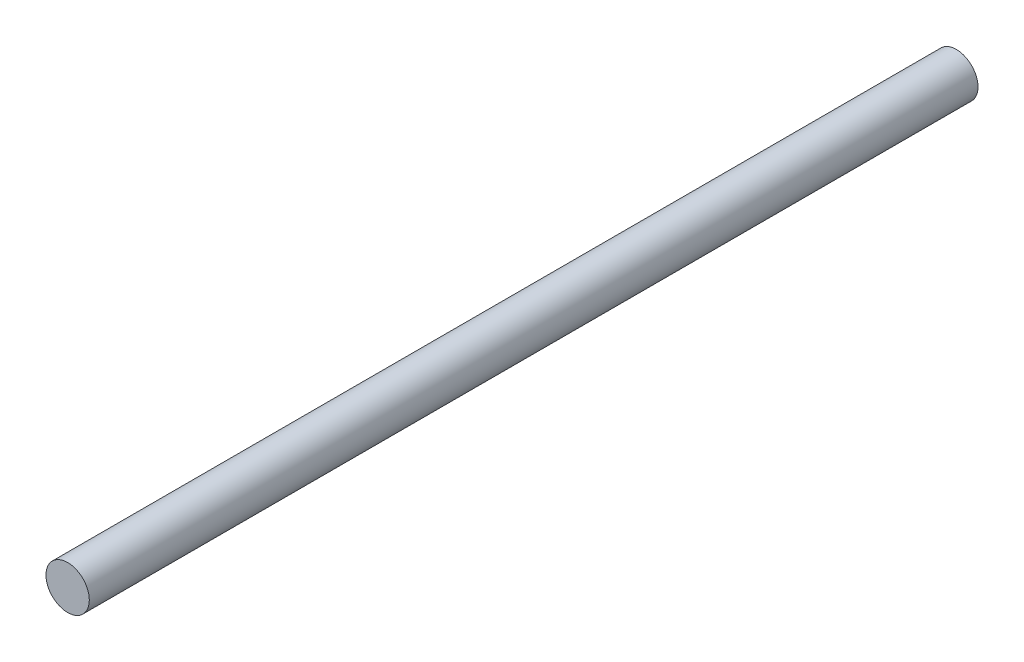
from build123d import *

# Parameters (mm, degrees)
SKETCH1_R      = 6.35
EXTRUDE1_DEPTH = 130.175


with BuildPart() as part:
    # Sketch1 → Extrude1 (new, symmetric)
    with BuildSketch(Plane.XY):
        Circle(SKETCH1_R)
    extrude(amount=EXTRUDE1_DEPTH, both=True)


solid = part.part
